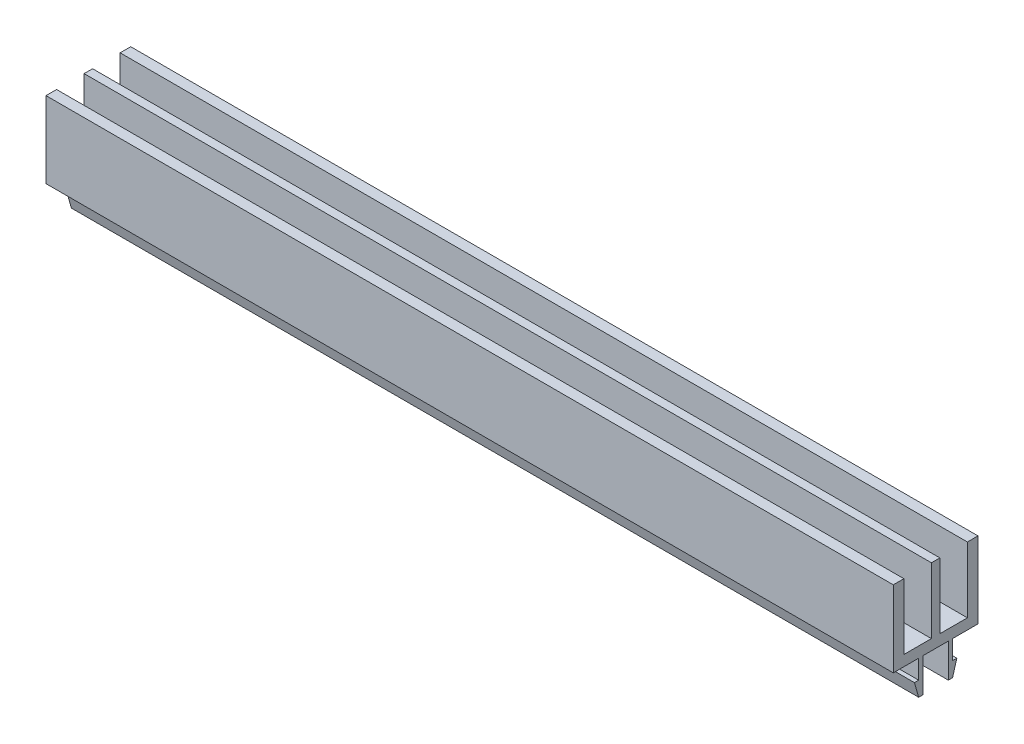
from build123d import *

# Parameters (mm, degrees)
PANEELILIU_UT_1_6024_PANEELILIUKU_2_1_DEPTH = 200


with BuildPart() as part:
    # Sketch1 → Paneeliliu_ut 1.6024 PANEELILIUKU 2_1 (new body)
    with BuildSketch(Plane(origin=(0, 0, 0), x_dir=(0, 0, -1), z_dir=(1, 0, 0))):
        Polygon((4.65552602, -4.410026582), (10.65552602, -4.410026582), (10.65552602, 13.589973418), (8.15552602, 13.589973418), (8.15552602, -1.910026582), (1.65552602, -1.910026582), (1.65552602, 13.589973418), (-0.34447398, 13.589973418), (-0.34447398, -1.910026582), (-6.84447398, -1.910026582), (-6.84447398, 13.589973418), (-9.34447398, 13.589973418), (-9.34447398, -4.410026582), (-3.34447398, -4.410026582), (-3.34447398, -8.910026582), (-4.34447398, -8.910026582), (-3.34447398, -12.410026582), (-2.34447398, -12.410026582), (-2.34447398, -4.410026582), (3.65552602, -4.410026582), (3.65552602, -12.410026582), (4.65552602, -12.410026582), (5.65552602, -8.910026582), (4.65552602, -8.910026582), align=None)
    extrude(amount=PANEELILIU_UT_1_6024_PANEELILIUKU_2_1_DEPTH)


solid = part.part
